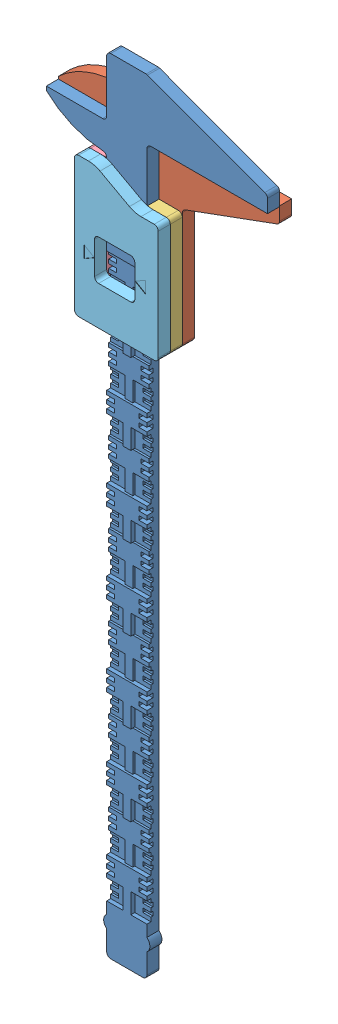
SolidWorks assembly Assemblage1.SLDASM, configuration Défaut (file format 10000). Lengths in mm.
Overall size (55 195 9).
5 component instances, 5 part files, 0 mates.
Components (placement in the parent):
- Tige fixe-1: Tige fixe.sldprt [Défaut] at origin size (55 195 3)
- coté machoire mov-1: coté machoire mov.sldprt [Défaut] at origin size (55 49.18 3)
- machoire mov-1: machoire mov.sldprt [Défaut] at origin size (5.82 29.3 3)
- arr machoir mov-1: arr machoir mov.sldprt [Défaut] at origin size (5 34.76 3)
- Curseur-1: Curseur.sldprt [Défaut] at origin size (20.82 34.76 3)
